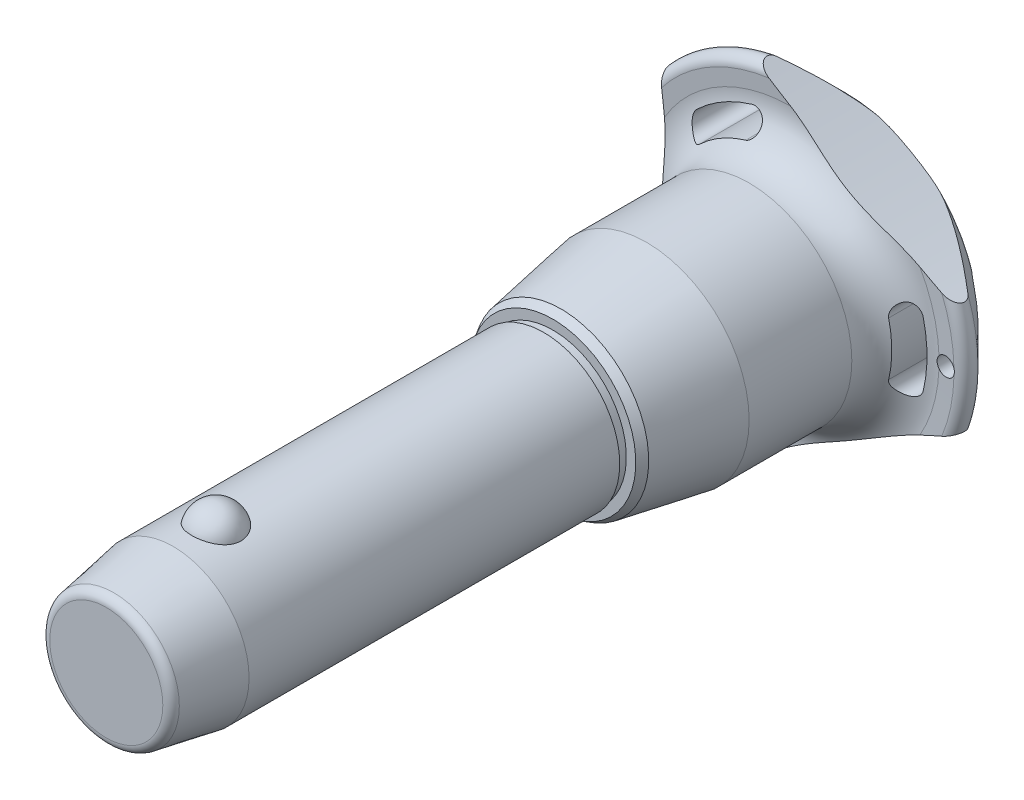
from build123d import *

# Parameters (mm, degrees)
SKETCH1_R           = 12.5
BOSS_EXTRUDE1_DEPTH = 50
SKETCH2_R           = 10
BOSS_EXTRUDE2_DEPTH = 50.7
BOSS_EXTRUDE3_START = 22
SKETCH1_2_R         = 12.5
BOSS_EXTRUDE3_DEPTH = 22
CHAMFER1_SIZE       = 11
CHAMFER1_SIZE2      = 1.939596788
FILLET1_R           = 1.5
SKETCH6_R           = 176.92625
CUT_EXTRUDE1_DEPTH  = 109.493284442
CIRPATTERN1_COUNT   = 3
SKETCH7_R           = 1.5
CUT_EXTRUDE2_DEPTH  = 109.35288326


with BuildPart() as part:
    # Sketch1 → Boss-Extrude1 (new body)
    with BuildSketch(Plane.XY):
        Circle(SKETCH1_R)
    extrude(amount=-BOSS_EXTRUDE1_DEPTH)

    # Sketch2 → Boss-Extrude2 (add)
    with BuildSketch(Plane(origin=(0, 0, -50), x_dir=(-1, 0, 0), z_dir=(0, 0, -1))):
        with Locations(Location((0, 0, 0), (0, 0, 180))):
            Circle(SKETCH2_R)
    extrude(amount=BOSS_EXTRUDE2_DEPTH)

    # Sketch3 → Revolve1 (revolve)
    with BuildSketch(Plane(origin=(0, 0, 0), x_dir=(0, 0, -1), z_dir=(1, 0, 0))):
        with BuildLine():
            Line((-3.957271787, 15.4), (-3.957271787, 7.1))
            ThreePointArc((-3.957271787, 7.1), (0.192728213, 11.25), (-3.957271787, 15.4))
        make_face()
        with BuildLine():
            Line((-3.957271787, -7.1), (-3.957271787, -15.4))
            ThreePointArc((-3.957271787, -15.4), (0.192728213, -11.25), (-3.957271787, -7.1))
        make_face()
    revolve(axis=Axis((0, -7.1, 3.957271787), (0, 1, 0)))

    # Sketch1_2 → Boss-Extrude3 (add)
    with BuildSketch(Plane.XY.offset(BOSS_EXTRUDE3_START)):
        Circle(SKETCH1_2_R)
    extrude(amount=-BOSS_EXTRUDE3_DEPTH)

    # Chamfer1
    chamfer1_edges = [part.edges().sort_by_distance(p)[0] for p in [
        (-12.5, 0, 22),
    ]]
    chamfer1_side = [part.faces().sort_by_distance(p)[0] for p in [
        (-12.5, 0, -14),
    ]]
    chamfer(chamfer1_edges, length=CHAMFER1_SIZE, length2=CHAMFER1_SIZE2, reference=chamfer1_side[0])

    # Fillet1
    fillet1_edges = [part.edges().sort_by_distance(p)[0] for p in [
        (-10.560403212, 0, 22),
        (-10, 0, -100.7),
    ]]
    fillet(fillet1_edges, radius=FILLET1_R)

    # Sketch4 → Revolve2 (revolve)
    with BuildSketch(Plane(origin=(0, 0, 0), x_dir=(0, 0, -1), z_dir=(1, 0, 0)), mode=Mode.PRIVATE) as revolve2_sk:
        Polygon((50, 0), (50, 12.089202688), (51.5, 12.089202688), (51.5, 13.644437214), (52.846872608, 14.422054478), (66.9, 16.9), (83.8, 16.9), (83.8, 0), align=None)
    revolve(revolve2_sk.sketch.rotate(Axis((0, 0, -83.8), (0, 0, 1)), 90), axis=Axis((0, 0, -83.8), (0, 0, 1)))

    # Sketch5 → Revolve3 (revolve)
    with BuildSketch(Plane(origin=(0, 0, 0), x_dir=(0, 0, -1), z_dir=(1, 0, 0)), mode=Mode.PRIVATE) as revolve3_sk:
        with BuildLine():
            Line((90.790129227, 24.271609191), (90.652256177, 26.865060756))
            ThreePointArc((90.652256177, 26.865060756), (91.598671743, 28.411427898), (93.38137085, 28.08137085))
            Line((93.38137085, 28.08137085), (99.763226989, 21.69951471))
            ThreePointArc((99.763226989, 21.69951471), (100.7, 19.381044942), (99.683055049, 17.096604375))
            ThreePointArc((99.683055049, 17.096604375), (94.18864484, 9.321268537), (92.25, 0))
            Line((92.25, 0), (83.8, 0))
            Line((83.8, 0), (83.8, 16.9))
            ThreePointArc((83.8, 16.9), (88.879432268, 19.083427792), (90.790129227, 24.271609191))
        make_face()
    revolve(revolve3_sk.sketch.rotate(Axis((0, 0, -92.25), (0, 0, 1)), 90), axis=Axis((0, 0, -92.25), (0, 0, 1)))

    # Sketch6 → Cut-Extrude1 (cut, through all)
    with BuildSketch(Plane.XY):
        with Locations((-197.42625, 0)):
            Circle(SKETCH6_R)
        with BuildLine():
            ThreePointArc((21.802992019, -5.260839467), (22.428706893, 0), (21.802992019, 5.260839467))
            ThreePointArc((21.802992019, 5.260839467), (19.579234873, 6.620060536), (18.220013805, 4.39630339))
            ThreePointArc((18.220013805, 4.39630339), (18.742902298, 0), (18.220013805, -4.39630339))
            ThreePointArc((18.220013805, -4.39630339), (19.579234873, -6.620060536), (21.802992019, -5.260839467))
        make_face()
    cut_extrude1 = extrude(amount=-CUT_EXTRUDE1_DEPTH, mode=Mode.SUBTRACT)

    # CirPattern1: Cut-Extrude1 ×3 about axis
    cirpattern1_axis = Axis((0, 0, 0), (0, 0, 1))
    for i in range(1, CIRPATTERN1_COUNT):
        add(cut_extrude1.rotate(cirpattern1_axis, i * 360 / CIRPATTERN1_COUNT), mode=Mode.SUBTRACT)

    # Sketch7 → Cut-Extrude2 (cut, through all)
    with BuildSketch(Plane.XY):
        with Locations(Location((25.428706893, 0, 0), (0, 0, 17.230769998))):
            Circle(SKETCH7_R)
    extrude(amount=-CUT_EXTRUDE2_DEPTH, mode=Mode.SUBTRACT)


solid = part.part
